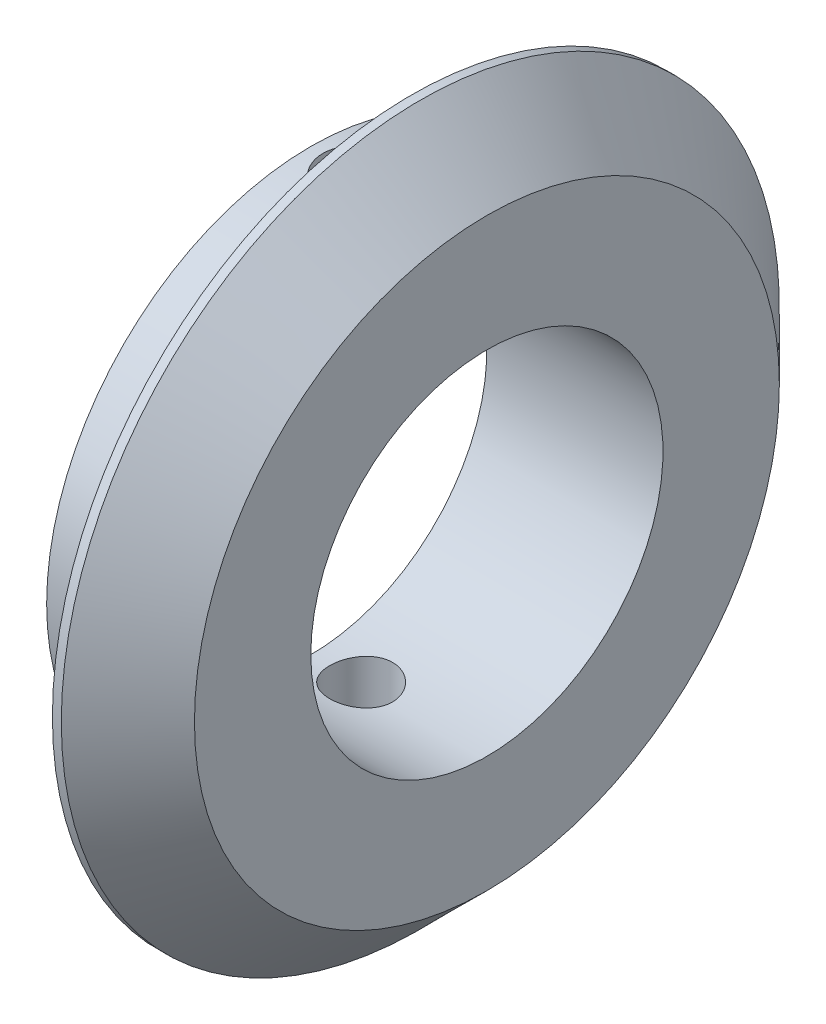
ISO-10303-21;
HEADER;
FILE_DESCRIPTION(('STEP AP214'),'2;1');
FILE_NAME('part.step','',(''),(''),'','','');
FILE_SCHEMA(('AUTOMOTIVE_DESIGN { 1 0 10303 214 1 1 1 1 }'));
ENDSEC;
DATA;
#1=APPLICATION_CONTEXT('core data for automotive mechanical design processes');
#2=APPLICATION_PROTOCOL_DEFINITION('international standard','automotive_design',2000,#1);
#3=PRODUCT_CONTEXT('',#1,'mechanical');
#4=PRODUCT('Part','Part','',(#3));
#5=PRODUCT_RELATED_PRODUCT_CATEGORY('part','',(#4));
#6=PRODUCT_DEFINITION_FORMATION('','',#4);
#7=PRODUCT_DEFINITION_CONTEXT('part definition',#1,'design');
#8=PRODUCT_DEFINITION('design','',#6,#7);
#9=PRODUCT_DEFINITION_SHAPE('','',#8);
#10=(LENGTH_UNIT() NAMED_UNIT(*) SI_UNIT(.MILLI.,.METRE.));
#11=(NAMED_UNIT(*) PLANE_ANGLE_UNIT() SI_UNIT($,.RADIAN.));
#12=(NAMED_UNIT(*) SI_UNIT($,.STERADIAN.) SOLID_ANGLE_UNIT());
#13=UNCERTAINTY_MEASURE_WITH_UNIT(LENGTH_MEASURE(1.E-05),#10,'distance_accuracy_value','');
#14=(GEOMETRIC_REPRESENTATION_CONTEXT(3) GLOBAL_UNCERTAINTY_ASSIGNED_CONTEXT((#13)) GLOBAL_UNIT_ASSIGNED_CONTEXT((#10,
#11,#12)) REPRESENTATION_CONTEXT('',''));
#15=CARTESIAN_POINT('',(0.,0.,0.));
#16=DIRECTION('',(0.,0.,1.));
#17=DIRECTION('',(1.,0.,0.));
#18=AXIS2_PLACEMENT_3D('',#15,#16,#17);
#19=CARTESIAN_POINT('',(3.9619976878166,20.,0.));
#20=DIRECTION('',(0.,1.,0.));
#21=DIRECTION('',(-1.,0.,0.));
#22=AXIS2_PLACEMENT_3D('',#19,#20,#21);
#23=CYLINDRICAL_SURFACE('',#22,3.);
#24=CARTESIAN_POINT('',(6.93633446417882,20.9963491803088,-0.391561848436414));
#25=CARTESIAN_POINT('',(6.91924504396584,20.9939283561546,-0.521374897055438));
#26=CARTESIAN_POINT('',(6.89364712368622,20.990317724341,-0.650044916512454));
#27=CARTESIAN_POINT('',(6.82588533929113,20.9809611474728,-0.90293604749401));
#28=CARTESIAN_POINT('',(6.78371274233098,20.9752140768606,-1.0271547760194));
#29=CARTESIAN_POINT('',(6.68352675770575,20.9619717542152,-1.2690256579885));
#30=CARTESIAN_POINT('',(6.62550292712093,20.9544753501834,-1.38667342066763));
#31=CARTESIAN_POINT('',(6.49460727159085,20.9382401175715,-1.61339170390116));
#32=CARTESIAN_POINT('',(6.42172693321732,20.9295005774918,-1.72245725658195));
#33=CARTESIAN_POINT('',(6.26236201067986,20.9113704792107,-1.93014581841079));
#34=CARTESIAN_POINT('',(6.17587291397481,20.901979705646,-2.0287653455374));
#35=CARTESIAN_POINT('',(5.99076378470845,20.8831851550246,-2.21387464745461));
#36=CARTESIAN_POINT('',(5.89214358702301,20.8737813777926,-2.30036425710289));
#37=CARTESIAN_POINT('',(5.68445450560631,20.855602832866,-2.4597295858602));
#38=CARTESIAN_POINT('',(5.5753890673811,20.8468278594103,-2.53260977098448));
#39=CARTESIAN_POINT('',(5.34867109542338,20.8305087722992,-2.66350524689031));
#40=CARTESIAN_POINT('',(5.23102350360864,20.8229639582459,-2.72152900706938));
#41=CARTESIAN_POINT('',(4.98915286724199,20.8096248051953,-2.8217148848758));
#42=CARTESIAN_POINT('',(4.8649342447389,20.8038293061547,-2.86388751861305));
#43=CARTESIAN_POINT('',(4.61204303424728,20.7943888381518,-2.93164931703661));
#44=CARTESIAN_POINT('',(4.48337286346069,20.7907427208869,-2.95724733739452));
#45=CARTESIAN_POINT('',(4.22380038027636,20.7858536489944,-2.99141907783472));
#46=CARTESIAN_POINT('',(4.09289903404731,20.784609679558,-2.99999998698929));
#47=CARTESIAN_POINT('',(3.83109634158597,20.7846096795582,-2.99999998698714));
#48=CARTESIAN_POINT('',(3.70019499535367,20.7858536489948,-2.99141907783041));
#49=CARTESIAN_POINT('',(3.44062251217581,20.7907427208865,-2.95724733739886));
#50=CARTESIAN_POINT('',(3.31195234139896,20.7943888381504,-2.93164931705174));
#51=CARTESIAN_POINT('',(3.05906113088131,20.8038293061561,-2.86388751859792));
#52=CARTESIAN_POINT('',(2.93484250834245,20.8096248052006,-2.8217148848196));
#53=CARTESIAN_POINT('',(2.69297187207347,20.8229639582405,-2.72152900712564));
#54=CARTESIAN_POINT('',(2.57532428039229,20.8305087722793,-2.66350524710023));
#55=CARTESIAN_POINT('',(2.34860630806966,20.8468278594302,-2.53260977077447));
#56=CARTESIAN_POINT('',(2.2395408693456,20.8556028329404,-2.45972958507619));
#57=CARTESIAN_POINT('',(2.03185250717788,20.8737813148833,-2.30036480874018));
#58=CARTESIAN_POINT('',(1.93323295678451,20.8831850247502,-2.21387584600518));
#59=CARTESIAN_POINT('',(1.74812366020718,20.9019795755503,-2.02876671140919));
#60=CARTESIAN_POINT('',(1.6616339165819,20.9113704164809,-1.93014653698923));
#61=CARTESIAN_POINT('',(1.50226844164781,20.9295005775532,-1.72245725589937));
#62=CARTESIAN_POINT('',(1.42938810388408,20.9382401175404,-1.61339170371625));
#63=CARTESIAN_POINT('',(1.29849244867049,20.9544753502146,-1.38667342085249));
#64=CARTESIAN_POINT('',(1.24046861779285,20.961971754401,-1.26902565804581));
#65=CARTESIAN_POINT('',(1.14028263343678,20.9752140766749,-1.02715477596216));
#66=CARTESIAN_POINT('',(1.09811003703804,20.9809611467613,-0.902936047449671));
#67=CARTESIAN_POINT('',(1.0303482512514,20.9903177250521,-0.650044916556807));
#68=CARTESIAN_POINT('',(1.00475032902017,20.9939283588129,-0.521374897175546));
#69=CARTESIAN_POINT('',(0.970578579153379,20.9987689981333,-0.261802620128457));
#70=CARTESIAN_POINT('',(0.961997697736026,20.9999999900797,-0.130901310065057));
#71=CARTESIAN_POINT('',(0.961997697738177,20.9999999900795,0.130901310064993));
#72=CARTESIAN_POINT('',(0.97057857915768,20.9987689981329,0.261802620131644));
#73=CARTESIAN_POINT('',(1.00475032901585,20.9939283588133,0.521374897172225));
#74=CARTESIAN_POINT('',(1.03034825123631,20.9903177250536,0.650044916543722));
#75=CARTESIAN_POINT('',(1.09811003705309,20.9809611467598,0.90293604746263));
#76=CARTESIAN_POINT('',(1.14028263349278,20.9752140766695,1.02715477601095));
#77=CARTESIAN_POINT('',(1.24046861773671,20.9619717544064,1.26902565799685));
#78=CARTESIAN_POINT('',(1.29849244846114,20.9544753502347,1.38667342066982));
#79=CARTESIAN_POINT('',(1.42938810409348,20.9382401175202,1.6133917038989));
#80=CARTESIAN_POINT('',(1.50226844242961,20.929500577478,1.72245725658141));
#81=CARTESIAN_POINT('',(1.66163336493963,20.9113704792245,1.93014581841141));
#82=CARTESIAN_POINT('',(1.74812246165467,20.9019797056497,2.0287653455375));
#83=CARTESIAN_POINT('',(1.93323159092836,20.8831851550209,2.21387464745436));
#84=CARTESIAN_POINT('',(2.03185178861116,20.8737813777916,2.30036425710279));
#85=CARTESIAN_POINT('',(2.23954087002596,20.855602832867,2.45972958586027));
#86=CARTESIAN_POINT('',(2.34860630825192,20.8468278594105,2.53260977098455));
#87=CARTESIAN_POINT('',(2.57532428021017,20.830508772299,2.66350524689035));
#88=CARTESIAN_POINT('',(2.69297187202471,20.8229639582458,2.72152900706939));
#89=CARTESIAN_POINT('',(2.93484250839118,20.8096248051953,2.82171488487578));
#90=CARTESIAN_POINT('',(3.05906113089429,20.8038293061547,2.86388751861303));
#91=CARTESIAN_POINT('',(3.31195234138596,20.7943888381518,2.93164931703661));
#92=CARTESIAN_POINT('',(3.44062251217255,20.7907427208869,2.95724733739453));
#93=CARTESIAN_POINT('',(3.70019499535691,20.7858536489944,2.99141907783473));
#94=CARTESIAN_POINT('',(3.83109634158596,20.784609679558,2.9999999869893));
#95=CARTESIAN_POINT('',(4.09289903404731,20.7846096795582,2.99999998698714));
#96=CARTESIAN_POINT('',(4.22380038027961,20.7858536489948,2.9914190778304));
#97=CARTESIAN_POINT('',(4.48337286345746,20.7907427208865,2.95724733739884));
#98=CARTESIAN_POINT('',(4.6120430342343,20.7943888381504,2.93164931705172));
#99=CARTESIAN_POINT('',(4.8649342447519,20.8038293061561,2.86388751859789));
#100=CARTESIAN_POINT('',(4.98915286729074,20.8096248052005,2.82171488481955));
#101=CARTESIAN_POINT('',(5.23102350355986,20.8229639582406,2.72152900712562));
#102=CARTESIAN_POINT('',(5.34867109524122,20.8305087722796,2.66350524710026));
#103=CARTESIAN_POINT('',(5.57538906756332,20.8468278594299,2.53260977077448));
#104=CARTESIAN_POINT('',(5.68445450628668,20.8556028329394,2.45972958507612));
#105=CARTESIAN_POINT('',(5.89214286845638,20.8737813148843,2.30036480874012));
#106=CARTESIAN_POINT('',(5.99076241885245,20.8831850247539,2.21387584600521));
#107=CARTESIAN_POINT('',(6.17587171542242,20.9019795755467,2.02876671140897));
#108=CARTESIAN_POINT('',(6.26236145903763,20.9113704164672,1.93014653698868));
#109=CARTESIAN_POINT('',(6.42172693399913,20.9295005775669,1.7224572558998));
#110=CARTESIAN_POINT('',(6.49460727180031,20.9382401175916,1.613391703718));
#111=CARTESIAN_POINT('',(6.62550292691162,20.9544753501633,1.38667342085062));
#112=CARTESIAN_POINT('',(6.68352675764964,20.9619717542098,1.26902565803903));
#113=CARTESIAN_POINT('',(6.78371274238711,20.9752140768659,1.02715477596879));
#114=CARTESIAN_POINT('',(6.82588533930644,20.9809611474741,0.902936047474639));
#115=CARTESIAN_POINT('',(6.89364712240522,20.9903177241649,0.650044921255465));
#116=CARTESIAN_POINT('',(6.91924504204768,20.9939283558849,0.521374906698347));
#117=CARTESIAN_POINT('',(6.95341679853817,20.9987690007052,0.261802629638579));
#118=CARTESIAN_POINT('',(6.9619976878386,21.000000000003,0.130901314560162));
#119=CARTESIAN_POINT('',(6.96199768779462,20.9999999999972,-0.130901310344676));
#120=CARTESIAN_POINT('',(6.95341679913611,20.9987690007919,-0.261802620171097));
#121=CARTESIAN_POINT('',(6.93633446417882,20.9963491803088,-0.391561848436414));
#122=B_SPLINE_CURVE_WITH_KNOTS('',3,(#24,#25,#26,#27,#28,#29,#30,#31,#32,#33,#34,#35,#36,#37,
#38,#39,#40,#41,#42,#43,#44,#45,#46,#47,#48,#49,#50,#51,#52,#53,#54,#55,#56,#57,#58,#59,#60,#61,
#62,#63,#64,#65,#66,#67,#68,#69,#70,#71,#72,#73,#74,#75,#76,#77,#78,#79,#80,#81,#82,#83,#84,#85,
#86,#87,#88,#89,#90,#91,#92,#93,#94,#95,#96,#97,#98,#99,#100,#101,#102,#103,#104,#105,#106,#107,
#108,#109,#110,#111,#112,#113,#114,#115,#116,#117,#118,#119,#120,#121),.UNSPECIFIED.,.T.,.F.,(4,
2,2,2,2,2,2,2,2,2,2,2,2,2,2,2,2,2,2,2,2,2,2,2,2,2,2,2,2,2,2,2,2,2,2,2,2,2,2,2,2,2,2,2,2,2,2,2,
4),(0.,0.392581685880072,0.785370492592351,1.17841869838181,1.57169277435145,1.96509753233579,
2.35850764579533,2.75178843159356,3.14484451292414,3.53763936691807,3.93022418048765,
4.32264310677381,4.71506203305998,5.10764684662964,5.50044170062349,5.89349778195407,
6.28677856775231,6.68018596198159,7.07359343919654,7.46686751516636,7.85991572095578,
8.25270452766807,8.64528621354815,9.03770513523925,9.43012405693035,9.82270574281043,
10.2154945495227,10.6085427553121,11.001816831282,11.395221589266,11.7886317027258,
12.1819124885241,12.5749685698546,12.9677634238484,13.3603482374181,13.7527671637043,
14.1451860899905,14.5377709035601,14.930565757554,15.3236218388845,15.7169026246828,
16.1103100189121,16.503717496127,16.8969915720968,17.2900397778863,17.6828285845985,
18.0754102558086,18.4678291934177,18.8602481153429),.UNSPECIFIED.);
#123=CARTESIAN_POINT('',(6.93633446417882,20.9963491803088,-0.391561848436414));
#124=VERTEX_POINT('',#123);
#125=EDGE_CURVE('E70',#124,#124,#122,.T.);
#126=ORIENTED_EDGE('',*,*,#125,.T.);
#127=EDGE_LOOP('',(#126));
#128=FACE_BOUND('',#127,.T.);
#129=CARTESIAN_POINT('',(3.9619976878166,20.,0.));
#130=DIRECTION('',(0.,1.,0.));
#131=DIRECTION('',(-1.,0.,0.));
#132=AXIS2_PLACEMENT_3D('',#129,#130,#131);
#133=CIRCLE('',#132,3.);
#134=CARTESIAN_POINT('',(0.961997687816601,20.,0.));
#135=VERTEX_POINT('',#134);
#136=EDGE_CURVE('E19',#135,#135,#133,.F.);
#137=ORIENTED_EDGE('',*,*,#136,.T.);
#138=EDGE_LOOP('',(#137));
#139=FACE_BOUND('',#138,.T.);
#140=ADVANCED_FACE('F15',(#128,#139),#23,.F.);
#141=CARTESIAN_POINT('',(0.90199768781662,20.,3.));
#142=DIRECTION('',(0.,-1.,0.));
#143=DIRECTION('',(0.,0.,-1.));
#144=AXIS2_PLACEMENT_3D('',#141,#142,#143);
#145=PLANE('',#144);
#146=CARTESIAN_POINT('',(4.,20.,0.));
#147=DIRECTION('',(0.,1.,0.));
#148=DIRECTION('',(0.,0.,1.));
#149=AXIS2_PLACEMENT_3D('',#146,#147,#148);
#150=CIRCLE('',#149,2.5);
#151=CARTESIAN_POINT('',(4.,20.,2.5));
#152=VERTEX_POINT('',#151);
#153=EDGE_CURVE('E112',#152,#152,#150,.T.);
#154=ORIENTED_EDGE('',*,*,#153,.F.);
#155=EDGE_LOOP('',(#154));
#156=FACE_BOUND('',#155,.T.);
#157=ORIENTED_EDGE('',*,*,#136,.F.);
#158=EDGE_LOOP('',(#157));
#159=FACE_BOUND('',#158,.T.);
#160=ADVANCED_FACE('F50',(#156,#159),#145,.F.);
#161=CARTESIAN_POINT('',(4.,13.7376271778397,0.));
#162=DIRECTION('',(0.,1.,0.));
#163=DIRECTION('',(0.,0.,1.));
#164=AXIS2_PLACEMENT_3D('',#161,#162,#163);
#165=CYLINDRICAL_SURFACE('',#164,2.5);
#166=ORIENTED_EDGE('',*,*,#153,.T.);
#167=EDGE_LOOP('',(#166));
#168=FACE_BOUND('',#167,.T.);
#169=CARTESIAN_POINT('',(4.00000016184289,13.7749773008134,2.49999998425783));
#170=CARTESIAN_POINT('',(4.10908546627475,13.7749773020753,2.49999997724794));
#171=CARTESIAN_POINT('',(4.21817076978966,13.776280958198,2.49284860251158));
#172=CARTESIAN_POINT('',(4.43448750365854,13.7814033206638,2.46437210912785));
#173=CARTESIAN_POINT('',(4.54171764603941,13.7852237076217,2.44303751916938));
#174=CARTESIAN_POINT('',(4.75246644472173,13.7951119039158,2.38656780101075));
#175=CARTESIAN_POINT('',(4.85598189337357,13.8011816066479,2.35142104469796));
#176=CARTESIAN_POINT('',(5.05754062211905,13.8151463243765,2.26793297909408));
#177=CARTESIAN_POINT('',(5.15557806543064,13.8230432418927,2.21957790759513));
#178=CARTESIAN_POINT('',(5.3445064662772,13.8401167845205,2.11050030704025));
#179=CARTESIAN_POINT('',(5.43539094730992,13.8492945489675,2.04976674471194));
#180=CARTESIAN_POINT('',(5.60845991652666,13.8682996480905,1.91696641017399));
#181=CARTESIAN_POINT('',(5.69063998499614,13.8781273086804,1.84489392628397));
#182=CARTESIAN_POINT('',(5.84489264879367,13.8977613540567,1.69064125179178));
#183=CARTESIAN_POINT('',(5.91696541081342,13.9075677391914,1.60846122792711));
#184=CARTESIAN_POINT('',(6.04976604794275,13.9264933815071,1.43539184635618));
#185=CARTESIAN_POINT('',(6.11049992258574,13.9356130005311,1.34450713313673));
#186=CARTESIAN_POINT('',(6.21957789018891,13.9525488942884,1.15557809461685));
#187=CARTESIAN_POINT('',(6.2679331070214,13.9603663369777,1.05754029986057));
#188=CARTESIAN_POINT('',(6.35142139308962,13.9741720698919,0.855981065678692));
#189=CARTESIAN_POINT('',(6.38656807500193,13.9801622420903,0.752465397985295));
#190=CARTESIAN_POINT('',(6.44303776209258,13.9899127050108,0.541716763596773));
#191=CARTESIAN_POINT('',(6.46437214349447,13.9936748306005,0.434486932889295));
#192=CARTESIAN_POINT('',(6.49284866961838,13.9987176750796,0.218170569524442));
#193=CARTESIAN_POINT('',(6.49999999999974,13.9999999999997,0.109085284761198));
#194=CARTESIAN_POINT('',(6.50000000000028,13.9999999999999,-0.109085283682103));
#195=CARTESIAN_POINT('',(6.49284866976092,13.9987176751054,-0.218170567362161));
#196=CARTESIAN_POINT('',(6.4643721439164,13.9936748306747,-0.434486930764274));
#197=CARTESIAN_POINT('',(6.44303776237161,13.9899127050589,-0.54171676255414));
#198=CARTESIAN_POINT('',(6.38656807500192,13.9801622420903,-0.75246539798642));
#199=CARTESIAN_POINT('',(6.35142139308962,13.9741720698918,-0.855981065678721));
#200=CARTESIAN_POINT('',(6.26793310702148,13.9603663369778,-1.05754029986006));
#201=CARTESIAN_POINT('',(6.21957789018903,13.9525488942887,-1.15557809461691));
#202=CARTESIAN_POINT('',(6.1104999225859,13.9356130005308,-1.34450713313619));
#203=CARTESIAN_POINT('',(6.04976604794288,13.9264933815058,-1.43539184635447));
#204=CARTESIAN_POINT('',(5.91696541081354,13.9075677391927,-1.60846122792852));
#205=CARTESIAN_POINT('',(5.84489264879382,13.8977613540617,-1.69064125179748));
#206=CARTESIAN_POINT('',(5.69063998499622,13.8781273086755,-1.84489392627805));
#207=CARTESIAN_POINT('',(5.60845991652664,13.8682996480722,-1.91696641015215));
#208=CARTESIAN_POINT('',(5.43539094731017,13.8492945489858,-2.0497667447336));
#209=CARTESIAN_POINT('',(5.3445064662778,13.8401167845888,-2.11050030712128));
#210=CARTESIAN_POINT('',(5.15557806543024,13.8230432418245,-2.21957790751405));
#211=CARTESIAN_POINT('',(5.05754062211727,13.8151463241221,-2.26793297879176));
#212=CARTESIAN_POINT('',(4.85598189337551,13.8011816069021,-2.35142104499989));
#213=CARTESIAN_POINT('',(4.75246644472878,13.795111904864,-2.38656780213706));
#214=CARTESIAN_POINT('',(4.54171764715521,13.7852237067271,-2.44303751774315));
#215=CARTESIAN_POINT('',(4.43448750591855,13.7814033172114,-2.46437210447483));
#216=CARTESIAN_POINT('',(4.21817071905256,13.7762809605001,-2.49284861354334));
#217=CARTESIAN_POINT('',(4.10908536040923,13.7749773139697,-2.49999999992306));
#218=CARTESIAN_POINT('',(3.89091464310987,13.7749773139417,-2.50000000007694));
#219=CARTESIAN_POINT('',(3.78182928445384,13.7762809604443,-2.49284861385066));
#220=CARTESIAN_POINT('',(3.56551249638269,13.7814033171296,-2.46437210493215));
#221=CARTESIAN_POINT('',(3.45828235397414,13.7852237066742,-2.44303751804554));
#222=CARTESIAN_POINT('',(3.24753355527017,13.7951119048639,-2.38656780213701));
#223=CARTESIAN_POINT('',(3.14401810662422,13.8011816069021,-2.35142104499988));
#224=CARTESIAN_POINT('',(2.94245937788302,13.8151463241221,-2.26793297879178));
#225=CARTESIAN_POINT('',(2.84442193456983,13.8230432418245,-2.21957790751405));
#226=CARTESIAN_POINT('',(2.65549353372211,13.8401167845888,-2.11050030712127));
#227=CARTESIAN_POINT('',(2.5646090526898,13.8492945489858,-2.04976674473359));
#228=CARTESIAN_POINT('',(2.39154008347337,13.8682996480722,-1.91696641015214));
#229=CARTESIAN_POINT('',(2.30936001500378,13.8781273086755,-1.84489392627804));
#230=CARTESIAN_POINT('',(2.15510735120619,13.8977613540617,-1.6906412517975));
#231=CARTESIAN_POINT('',(2.08303458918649,13.9075677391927,-1.60846122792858));
#232=CARTESIAN_POINT('',(1.95023395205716,13.9264933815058,-1.43539184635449));
#233=CARTESIAN_POINT('',(1.88950007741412,13.9356130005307,-1.34450713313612));
#234=CARTESIAN_POINT('',(1.78042210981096,13.9525488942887,-1.155578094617));
#235=CARTESIAN_POINT('',(1.73206689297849,13.9603663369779,-1.05754029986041));
#236=CARTESIAN_POINT('',(1.6485786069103,13.9741720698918,-0.855981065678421));
#237=CARTESIAN_POINT('',(1.61343192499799,13.9801622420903,-0.752465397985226));
#238=CARTESIAN_POINT('',(1.55696223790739,13.9899127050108,-0.54171676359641));
#239=CARTESIAN_POINT('',(1.53562785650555,13.9936748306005,-0.434486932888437));
#240=CARTESIAN_POINT('',(1.5071513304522,13.9987176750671,-0.218170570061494));
#241=CARTESIAN_POINT('',(1.50000000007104,13.9999999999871,-0.109085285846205));
#242=CARTESIAN_POINT('',(1.49999999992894,14.0000000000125,0.109085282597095));
#243=CARTESIAN_POINT('',(1.5071513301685,13.9987176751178,0.218170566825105));
#244=CARTESIAN_POINT('',(1.53562785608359,13.9936748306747,0.434486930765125));
#245=CARTESIAN_POINT('',(1.55696223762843,13.9899127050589,0.541716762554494));
#246=CARTESIAN_POINT('',(1.61343192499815,13.9801622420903,0.752465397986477));
#247=CARTESIAN_POINT('',(1.64857860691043,13.9741720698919,0.855981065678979));
#248=CARTESIAN_POINT('',(1.73206689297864,13.9603663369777,1.05754029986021));
#249=CARTESIAN_POINT('',(1.78042210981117,13.9525488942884,1.15557809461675));
#250=CARTESIAN_POINT('',(1.88950007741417,13.9356130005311,1.34450713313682));
#251=CARTESIAN_POINT('',(1.95023395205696,13.9264933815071,1.4353918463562));
#252=CARTESIAN_POINT('',(2.08303458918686,13.9075677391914,1.60846122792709));
#253=CARTESIAN_POINT('',(2.15510735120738,13.8977613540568,1.69064125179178));
#254=CARTESIAN_POINT('',(2.30936001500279,13.8781273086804,1.84489392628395));
#255=CARTESIAN_POINT('',(2.39154008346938,13.8682996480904,1.91696641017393));
#256=CARTESIAN_POINT('',(2.56460905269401,13.8492945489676,2.04976674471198));
#257=CARTESIAN_POINT('',(2.65549353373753,13.840116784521,2.11050030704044));
#258=CARTESIAN_POINT('',(2.84442193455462,13.8230432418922,2.21957790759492));
#259=CARTESIAN_POINT('',(2.94245937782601,13.8151463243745,2.26793297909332));
#260=CARTESIAN_POINT('',(3.14401810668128,13.8011816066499,2.3514210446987));
#261=CARTESIAN_POINT('',(3.24753355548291,13.7951119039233,2.38656780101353));
#262=CARTESIAN_POINT('',(3.45828222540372,13.7852237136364,2.44303748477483));
#263=CARTESIAN_POINT('',(3.56551223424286,13.7814033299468,2.46437205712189));
#264=CARTESIAN_POINT('',(3.78182907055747,13.7762809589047,2.49284859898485));
#265=CARTESIAN_POINT('',(3.89091461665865,13.7749772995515,2.49999999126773));
#266=CARTESIAN_POINT('',(4.00000016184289,13.7749773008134,2.49999998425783));
#267=B_SPLINE_CURVE_WITH_KNOTS('',3,(#169,#170,#171,#172,#173,#174,#175,#176,#177,#178,#179,
#180,#181,#182,#183,#184,#185,#186,#187,#188,#189,#190,#191,#192,#193,#194,#195,#196,#197,#198,
#199,#200,#201,#202,#203,#204,#205,#206,#207,#208,#209,#210,#211,#212,#213,#214,#215,#216,#217,
#218,#219,#220,#221,#222,#223,#224,#225,#226,#227,#228,#229,#230,#231,#232,#233,#234,#235,#236,
#237,#238,#239,#240,#241,#242,#243,#244,#245,#246,#247,#248,#249,#250,#251,#252,#253,#254,#255,
#256,#257,#258,#259,#260,#261,#262,#263,#264,#265,#266),.UNSPECIFIED.,.T.,.F.,(4,2,2,2,2,2,2,2,
2,2,2,2,2,2,2,2,2,2,2,2,2,2,2,2,2,2,2,2,2,2,2,2,2,2,2,2,2,2,2,2,2,2,2,2,2,2,2,2,4),(0.,
0.327015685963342,0.654249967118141,0.981760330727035,1.30961324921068,1.63775967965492,
1.96607193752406,2.2943787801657,2.62251141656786,2.95034813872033,3.27784606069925,
3.60507390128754,3.93208974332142,4.25910558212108,4.58633342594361,4.91383134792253,
5.24166807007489,5.56980070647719,5.89810754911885,6.22641980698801,6.55456623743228,
6.88241915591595,7.20992951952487,7.53716379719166,7.86417964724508,8.19119549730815,
8.51842977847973,8.84594014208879,9.17379306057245,9.50193949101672,9.83025174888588,
10.1585585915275,10.4866912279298,10.8145279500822,11.1420258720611,11.4692537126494,
11.7962695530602,12.1232853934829,12.4505132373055,12.7780111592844,13.1058478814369,
13.433980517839,13.7622873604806,14.0905996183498,14.418746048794,14.7465989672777,
15.0741093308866,15.4013432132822,15.7283596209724),.UNSPECIFIED.);
#268=CARTESIAN_POINT('',(4.00000016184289,13.7749773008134,2.49999998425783));
#269=VERTEX_POINT('',#268);
#270=EDGE_CURVE('E10',#269,#269,#267,.T.);
#271=ORIENTED_EDGE('',*,*,#270,.F.);
#272=EDGE_LOOP('',(#271));
#273=FACE_BOUND('',#272,.T.);
#274=ADVANCED_FACE('F44',(#168,#273),#165,.F.);
#275=CARTESIAN_POINT('',(8.,-39.868777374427,6.3145939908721));
#276=DIRECTION('',(-1.,0.,0.));
#277=DIRECTION('',(0.,0.809016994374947,0.587785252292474));
#278=AXIS2_PLACEMENT_3D('',#275,#276,#277);
#279=PLANE('',#278);
#280=CARTESIAN_POINT('',(8.,0.,0.));
#281=DIRECTION('',(-1.,0.,0.));
#282=DIRECTION('',(0.,0.,1.));
#283=AXIS2_PLACEMENT_3D('',#280,#281,#282);
#284=CIRCLE('',#283,21.0000000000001);
#285=CARTESIAN_POINT('',(8.,0.,21.0000000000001));
#286=VERTEX_POINT('',#285);
#287=EDGE_CURVE('E111',#286,#286,#284,.F.);
#288=ORIENTED_EDGE('',*,*,#287,.T.);
#289=EDGE_LOOP('',(#288));
#290=FACE_BOUND('',#289,.T.);
#291=CARTESIAN_POINT('',(8.,0.,0.));
#292=DIRECTION('',(-1.,0.,0.));
#293=DIRECTION('',(0.,0.,1.));
#294=AXIS2_PLACEMENT_3D('',#291,#292,#293);
#295=CIRCLE('',#294,28.5428932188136);
#296=CARTESIAN_POINT('',(8.,0.,28.5428932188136));
#297=VERTEX_POINT('',#296);
#298=EDGE_CURVE('E109',#297,#297,#295,.T.);
#299=ORIENTED_EDGE('',*,*,#298,.T.);
#300=EDGE_LOOP('',(#299));
#301=FACE_BOUND('',#300,.T.);
#302=ADVANCED_FACE('F49',(#290,#301),#279,.T.);
#303=CARTESIAN_POINT('',(8.7071067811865,0.,0.));
#304=DIRECTION('',(-1.,0.,0.));
#305=DIRECTION('',(0.,0.,1.));
#306=AXIS2_PLACEMENT_3D('',#303,#304,#305);
#307=CYLINDRICAL_SURFACE('',#306,28.5428932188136);
#308=CARTESIAN_POINT('',(8.7071067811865,0.,0.));
#309=DIRECTION('',(-1.,0.,0.));
#310=DIRECTION('',(0.,0.80901699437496,0.587785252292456));
#311=AXIS2_PLACEMENT_3D('',#308,#309,#310);
#312=CIRCLE('',#311,28.5428932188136);
#313=CARTESIAN_POINT('',(8.7071067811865,23.09168568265,16.777091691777));
#314=VERTEX_POINT('',#313);
#315=EDGE_CURVE('E75',#314,#314,#312,.T.);
#316=ORIENTED_EDGE('',*,*,#315,.T.);
#317=EDGE_LOOP('',(#316));
#318=FACE_BOUND('',#317,.T.);
#319=ORIENTED_EDGE('',*,*,#298,.F.);
#320=EDGE_LOOP('',(#319));
#321=FACE_BOUND('',#320,.T.);
#322=ADVANCED_FACE('F53',(#318,#321),#307,.T.);
#323=CARTESIAN_POINT('',(8.,0.,0.));
#324=DIRECTION('',(-1.,0.,0.));
#325=DIRECTION('',(0.,0.,1.));
#326=AXIS2_PLACEMENT_3D('',#323,#324,#325);
#327=CYLINDRICAL_SURFACE('',#326,21.0000000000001);
#328=ORIENTED_EDGE('',*,*,#287,.F.);
#329=EDGE_LOOP('',(#328));
#330=FACE_BOUND('',#329,.T.);
#331=ORIENTED_EDGE('',*,*,#125,.F.);
#332=EDGE_LOOP('',(#331));
#333=FACE_BOUND('',#332,.T.);
#334=CARTESIAN_POINT('',(3.67366169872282,-20.8532130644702,2.47860910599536));
#335=CARTESIAN_POINT('',(3.56552217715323,-20.8549053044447,2.46437127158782));
#336=CARTESIAN_POINT('',(3.45832910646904,-20.8574285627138,2.4430474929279));
#337=CARTESIAN_POINT('',(3.24759919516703,-20.8639641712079,2.38658780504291));
#338=CARTESIAN_POINT('',(3.14406540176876,-20.8679777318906,2.35144066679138));
#339=CARTESIAN_POINT('',(2.94248925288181,-20.877216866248,2.26794530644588));
#340=CARTESIAN_POINT('',(2.84444849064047,-20.8824427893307,2.21959327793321));
#341=CARTESIAN_POINT('',(2.65551536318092,-20.8937487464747,2.11051284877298));
#342=CARTESIAN_POINT('',(2.56462583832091,-20.8998291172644,2.04977956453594));
#343=CARTESIAN_POINT('',(2.39154897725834,-20.9124282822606,1.91697324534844));
#344=CARTESIAN_POINT('',(2.30936366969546,-20.918947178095,1.84489757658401));
#345=CARTESIAN_POINT('',(2.15510327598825,-20.9319786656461,1.6906371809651));
#346=CARTESIAN_POINT('',(2.0830280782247,-20.9384912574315,1.6084525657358));
#347=CARTESIAN_POINT('',(1.95022179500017,-20.9510671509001,1.43537611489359));
#348=CARTESIAN_POINT('',(1.88948815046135,-20.9571305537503,1.34448625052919));
#349=CARTESIAN_POINT('',(1.78040728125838,-20.9683963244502,1.15555259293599));
#350=CARTESIAN_POINT('',(1.73205512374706,-20.9735990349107,1.05751166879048));
#351=CARTESIAN_POINT('',(1.64855966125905,-20.982791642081,0.855935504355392));
#352=CARTESIAN_POINT('',(1.61341254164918,-20.9867818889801,0.752401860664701));
#353=CARTESIAN_POINT('',(1.55695237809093,-20.9932772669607,0.54167073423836));
#354=CARTESIAN_POINT('',(1.53562836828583,-20.995783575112,0.43447622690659));
#355=CARTESIAN_POINT('',(1.50715175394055,-20.9991449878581,0.218187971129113));
#356=CARTESIAN_POINT('',(1.50000002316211,-20.9999999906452,0.109094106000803));
#357=CARTESIAN_POINT('',(1.49999998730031,-20.9999999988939,-0.109083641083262));
#358=CARTESIAN_POINT('',(1.50715038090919,-20.999145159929,-0.218167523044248));
#359=CARTESIAN_POINT('',(1.5356267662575,-20.995783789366,-0.434474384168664));
#360=CARTESIAN_POINT('',(1.55695685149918,-20.9932767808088,-0.541696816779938));
#361=CARTESIAN_POINT('',(1.61342414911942,-20.9867806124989,-0.752436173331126));
#362=CARTESIAN_POINT('',(1.64856640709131,-20.9827909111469,-0.855951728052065));
#363=CARTESIAN_POINT('',(1.73205468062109,-20.9735990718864,-1.05751066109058));
#364=CARTESIAN_POINT('',(1.78040673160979,-20.9683963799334,-1.1555515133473));
#365=CARTESIAN_POINT('',(1.88948723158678,-20.9571306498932,-1.34448478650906));
#366=CARTESIAN_POINT('',(1.950220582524,-20.9510672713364,-1.43537435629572));
#367=CARTESIAN_POINT('',(2.08302696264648,-20.9384913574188,-1.60845129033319));
#368=CARTESIAN_POINT('',(2.15510268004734,-20.9319787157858,-1.69063658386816));
#369=CARTESIAN_POINT('',(2.30936305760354,-20.9189472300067,-1.84489696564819));
#370=CARTESIAN_POINT('',(2.39154767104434,-20.9124283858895,-1.91697210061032));
#371=CARTESIAN_POINT('',(2.56462403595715,-20.8998292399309,-2.04977832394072));
#372=CARTESIAN_POINT('',(2.65551386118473,-20.893748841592,-2.11051191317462));
#373=CARTESIAN_POINT('',(2.84444740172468,-20.8824428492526,-2.21959271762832));
#374=CARTESIAN_POINT('',(2.94248825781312,-20.8772169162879,-2.26794484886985));
#375=CARTESIAN_POINT('',(3.14406454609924,-20.867977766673,-2.35144035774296));
#376=CARTESIAN_POINT('',(3.2475983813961,-20.8639641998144,-2.38658755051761));
#377=CARTESIAN_POINT('',(3.45832844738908,-20.8574285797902,-2.44304735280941));
#378=CARTESIAN_POINT('',(3.56552163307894,-20.8549053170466,-2.46437118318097));
#379=CARTESIAN_POINT('',(3.78180966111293,-20.8515206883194,-2.49284806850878));
#380=CARTESIAN_POINT('',(3.8909046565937,-20.8506594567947,-2.4999999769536));
#381=CARTESIAN_POINT('',(4.1090946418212,-20.8506594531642,-2.50000000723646));
#382=CARTESIAN_POINT('',(4.21818963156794,-20.8515206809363,-2.4928481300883));
#383=CARTESIAN_POINT('',(4.43447763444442,-20.8549053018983,-2.46437131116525));
#384=CARTESIAN_POINT('',(4.54167080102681,-20.8574285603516,-2.44304751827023));
#385=CARTESIAN_POINT('',(4.75240080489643,-20.8639641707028,-2.38658780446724));
#386=CARTESIAN_POINT('',(4.85593459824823,-20.8679777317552,-2.35144066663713));
#387=CARTESIAN_POINT('',(5.05751074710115,-20.8772168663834,-2.26794530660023));
#388=CARTESIAN_POINT('',(5.15555150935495,-20.882442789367,-2.2195932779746));
#389=CARTESIAN_POINT('',(5.34448463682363,-20.8937487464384,-2.11051284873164));
#390=CARTESIAN_POINT('',(5.43537416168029,-20.8998291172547,-2.04977956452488));
#391=CARTESIAN_POINT('',(5.60845102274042,-20.9124282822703,-1.91697324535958));
#392=CARTESIAN_POINT('',(5.6906363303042,-20.9189471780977,-1.84489757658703));
#393=CARTESIAN_POINT('',(5.84489672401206,-20.9319786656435,-1.69063718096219));
#394=CARTESIAN_POINT('',(5.91697192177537,-20.9384912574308,-1.60845256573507));
#395=CARTESIAN_POINT('',(6.04977820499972,-20.9510671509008,-1.43537611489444));
#396=CARTESIAN_POINT('',(6.11051184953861,-20.9571305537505,-1.34448625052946));
#397=CARTESIAN_POINT('',(6.21959271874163,-20.96839632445,-1.15555259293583));
#398=CARTESIAN_POINT('',(6.26794487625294,-20.9735990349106,-1.05751166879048));
#399=CARTESIAN_POINT('',(6.35144033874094,-20.9827916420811,-0.855935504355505));
#400=CARTESIAN_POINT('',(6.38658745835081,-20.9867818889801,-0.752401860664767));
#401=CARTESIAN_POINT('',(6.44304762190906,-20.9932772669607,-0.541670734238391));
#402=CARTESIAN_POINT('',(6.46437163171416,-20.995783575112,-0.434476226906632));
#403=CARTESIAN_POINT('',(6.49284824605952,-20.9991449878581,-0.21818797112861));
#404=CARTESIAN_POINT('',(6.49999997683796,-20.9999999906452,-0.109094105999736));
#405=CARTESIAN_POINT('',(6.50000001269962,-20.9999999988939,0.109083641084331));
#406=CARTESIAN_POINT('',(6.49284961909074,-20.999145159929,0.218167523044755));
#407=CARTESIAN_POINT('',(6.46437323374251,-20.995783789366,0.434474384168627));
#408=CARTESIAN_POINT('',(6.44304314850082,-20.9932767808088,0.54169681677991));
#409=CARTESIAN_POINT('',(6.3865758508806,-20.9867806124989,0.752436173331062));
#410=CARTESIAN_POINT('',(6.35143359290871,-20.9827909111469,0.855951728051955));
#411=CARTESIAN_POINT('',(6.26794531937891,-20.9735990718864,1.05751066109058));
#412=CARTESIAN_POINT('',(6.2195932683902,-20.9683963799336,1.15555151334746));
#413=CARTESIAN_POINT('',(6.11051276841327,-20.957130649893,1.3444847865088));
#414=CARTESIAN_POINT('',(6.04977941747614,-20.9510672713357,1.43537435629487));
#415=CARTESIAN_POINT('',(5.91697303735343,-20.9384913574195,1.60845129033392));
#416=CARTESIAN_POINT('',(5.84489731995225,-20.9319787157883,1.69063658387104));
#417=CARTESIAN_POINT('',(5.6906369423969,-20.9189472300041,1.84489696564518));
#418=CARTESIAN_POINT('',(5.60845232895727,-20.9124283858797,1.91697210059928));
#419=CARTESIAN_POINT('',(5.43537596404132,-20.8998292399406,2.0497783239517));
#420=CARTESIAN_POINT('',(5.34448613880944,-20.8937488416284,2.11051191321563));
#421=CARTESIAN_POINT('',(5.1555525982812,-20.8824428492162,2.21959271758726));
#422=CARTESIAN_POINT('',(5.05751174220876,-20.8772169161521,2.26794484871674));
#423=CARTESIAN_POINT('',(4.85593545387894,-20.8679777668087,2.35144035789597));
#424=CARTESIAN_POINT('',(4.75240161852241,-20.8639642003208,2.38658755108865));
#425=CARTESIAN_POINT('',(4.54167162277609,-20.8574285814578,2.44304733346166));
#426=CARTESIAN_POINT('',(4.43447850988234,-20.8549053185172,2.46437115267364));
#427=CARTESIAN_POINT('',(4.21819040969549,-20.8515206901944,2.49284807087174));
#428=CARTESIAN_POINT('',(4.10909526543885,-20.8506594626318,2.49999999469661));
#429=CARTESIAN_POINT('',(3.89090511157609,-20.8506594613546,2.50000000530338));
#430=CARTESIAN_POINT('',(3.78181010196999,-20.8515206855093,2.49284810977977));
#431=CARTESIAN_POINT('',(3.67366169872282,-20.8532130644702,2.47860910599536));
#432=B_SPLINE_CURVE_WITH_KNOTS('',3,(#334,#335,#336,#337,#338,#339,#340,#341,#342,#343,#344,
#345,#346,#347,#348,#349,#350,#351,#352,#353,#354,#355,#356,#357,#358,#359,#360,#361,#362,#363,
#364,#365,#366,#367,#368,#369,#370,#371,#372,#373,#374,#375,#376,#377,#378,#379,#380,#381,#382,
#383,#384,#385,#386,#387,#388,#389,#390,#391,#392,#393,#394,#395,#396,#397,#398,#399,#400,#401,
#402,#403,#404,#405,#406,#407,#408,#409,#410,#411,#412,#413,#414,#415,#416,#417,#418,#419,#420,
#421,#422,#423,#424,#425,#426,#427,#428,#429,#430,#431),.UNSPECIFIED.,.T.,.F.,(4,2,2,2,2,2,2,2,
2,2,2,2,2,2,2,2,2,2,2,2,2,2,2,2,2,2,2,2,2,2,2,2,2,2,2,2,2,2,2,2,2,2,2,2,2,2,2,2,4),(0.,
0.327021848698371,0.654309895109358,0.981692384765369,1.30920425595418,1.6367922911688,
1.96437670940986,2.29188712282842,2.6192668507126,2.94655193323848,3.27357706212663,
3.6006223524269,3.92763788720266,4.25474786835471,4.58197745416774,4.90935679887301,
5.23686601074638,5.56445296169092,5.89203839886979,6.21955151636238,6.54693439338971,
6.87422261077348,7.20124482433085,7.52829349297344,7.85534213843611,8.18236427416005,
8.50965232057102,8.83703481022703,9.16454668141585,9.49213471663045,9.8197191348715,
10.1472295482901,10.4746092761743,10.8018943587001,11.1289194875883,11.4559647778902,
11.7829803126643,12.1100902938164,12.4373198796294,12.7646992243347,13.092208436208,
13.4197953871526,13.7473808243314,14.0748939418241,14.4022768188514,14.7295650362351,
15.0565870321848,15.3836361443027,15.7106848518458),.UNSPECIFIED.);
#433=CARTESIAN_POINT('',(3.67366169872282,-20.8532130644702,2.47860910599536));
#434=VERTEX_POINT('',#433);
#435=EDGE_CURVE('E65',#434,#434,#432,.T.);
#436=ORIENTED_EDGE('',*,*,#435,.F.);
#437=EDGE_LOOP('',(#436));
#438=FACE_BOUND('',#437,.T.);
#439=CARTESIAN_POINT('',(0.,0.,0.));
#440=DIRECTION('',(-1.,0.,0.));
#441=DIRECTION('',(0.,0.,1.));
#442=AXIS2_PLACEMENT_3D('',#439,#440,#441);
#443=CIRCLE('',#442,21.0000000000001);
#444=CARTESIAN_POINT('',(0.,0.,21.0000000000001));
#445=VERTEX_POINT('',#444);
#446=EDGE_CURVE('E78',#445,#445,#443,.T.);
#447=ORIENTED_EDGE('',*,*,#446,.F.);
#448=EDGE_LOOP('',(#447));
#449=FACE_BOUND('',#448,.T.);
#450=ADVANCED_FACE('F56',(#330,#333,#438,#449),#327,.T.);
#451=CARTESIAN_POINT('',(14.,0.,0.));
#452=DIRECTION('',(-1.,0.,0.));
#453=DIRECTION('',(0.,0.,1.));
#454=AXIS2_PLACEMENT_3D('',#451,#452,#453);
#455=CONICAL_SURFACE('',#454,23.2500000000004,0.785398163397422);
#456=CARTESIAN_POINT('',(14.,0.,0.));
#457=DIRECTION('',(-1.,0.,0.));
#458=DIRECTION('',(0.,0.,1.));
#459=AXIS2_PLACEMENT_3D('',#456,#457,#458);
#460=CIRCLE('',#459,23.2500000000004);
#461=CARTESIAN_POINT('',(14.,0.,23.2500000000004));
#462=VERTEX_POINT('',#461);
#463=EDGE_CURVE('E81',#462,#462,#460,.F.);
#464=ORIENTED_EDGE('',*,*,#463,.F.);
#465=EDGE_LOOP('',(#464));
#466=FACE_BOUND('',#465,.T.);
#467=ORIENTED_EDGE('',*,*,#315,.F.);
#468=EDGE_LOOP('',(#467));
#469=FACE_BOUND('',#468,.T.);
#470=ADVANCED_FACE('F61',(#466,#469),#455,.T.);
#471=CARTESIAN_POINT('',(0.,-29.332847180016,4.645866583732));
#472=DIRECTION('',(-1.,0.,0.));
#473=DIRECTION('',(0.,0.809016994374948,0.587785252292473));
#474=AXIS2_PLACEMENT_3D('',#471,#472,#473);
#475=PLANE('',#474);
#476=CARTESIAN_POINT('',(0.,0.,0.));
#477=DIRECTION('',(-1.,0.,0.));
#478=DIRECTION('',(0.,0.,1.));
#479=AXIS2_PLACEMENT_3D('',#476,#477,#478);
#480=CIRCLE('',#479,13.9999999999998);
#481=CARTESIAN_POINT('',(0.,0.,13.9999999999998));
#482=VERTEX_POINT('',#481);
#483=EDGE_CURVE('E86',#482,#482,#480,.T.);
#484=ORIENTED_EDGE('',*,*,#483,.F.);
#485=EDGE_LOOP('',(#484));
#486=FACE_BOUND('',#485,.T.);
#487=ORIENTED_EDGE('',*,*,#446,.T.);
#488=EDGE_LOOP('',(#487));
#489=FACE_BOUND('',#488,.T.);
#490=ADVANCED_FACE('F99',(#486,#489),#475,.T.);
#491=CARTESIAN_POINT('',(14.,-5.1436380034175,-32.475652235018));
#492=DIRECTION('',(1.,0.,0.));
#493=DIRECTION('',(0.,0.809016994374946,0.587785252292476));
#494=AXIS2_PLACEMENT_3D('',#491,#492,#493);
#495=PLANE('',#494);
#496=CARTESIAN_POINT('',(14.,0.,0.));
#497=DIRECTION('',(-1.,0.,0.));
#498=DIRECTION('',(0.,0.,1.));
#499=AXIS2_PLACEMENT_3D('',#496,#497,#498);
#500=CIRCLE('',#499,13.9999999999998);
#501=CARTESIAN_POINT('',(14.,0.,13.9999999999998));
#502=VERTEX_POINT('',#501);
#503=EDGE_CURVE('E28',#502,#502,#500,.F.);
#504=ORIENTED_EDGE('',*,*,#503,.F.);
#505=EDGE_LOOP('',(#504));
#506=FACE_BOUND('',#505,.T.);
#507=ORIENTED_EDGE('',*,*,#463,.T.);
#508=EDGE_LOOP('',(#507));
#509=FACE_BOUND('',#508,.T.);
#510=ADVANCED_FACE('F17',(#506,#509),#495,.T.);
#511=CARTESIAN_POINT('',(4.,-21.,0.));
#512=DIRECTION('',(0.,1.,0.));
#513=DIRECTION('',(0.,0.,1.));
#514=AXIS2_PLACEMENT_3D('',#511,#512,#513);
#515=CYLINDRICAL_SURFACE('',#514,2.5);
#516=CARTESIAN_POINT('',(3.99999983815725,-13.7749773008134,2.49999998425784));
#517=CARTESIAN_POINT('',(3.89091453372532,-13.7749773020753,2.49999997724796));
#518=CARTESIAN_POINT('',(3.78182923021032,-13.776280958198,2.49284860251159));
#519=CARTESIAN_POINT('',(3.5655124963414,-13.7814033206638,2.46437210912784));
#520=CARTESIAN_POINT('',(3.45828235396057,-13.7852237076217,2.44303751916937));
#521=CARTESIAN_POINT('',(3.24753355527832,-13.7951119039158,2.38656780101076));
#522=CARTESIAN_POINT('',(3.14401810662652,-13.8011816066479,2.35142104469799));
#523=CARTESIAN_POINT('',(2.942459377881,-13.8151463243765,2.2679329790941));
#524=CARTESIAN_POINT('',(2.84442193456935,-13.8230432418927,2.21957790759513));
#525=CARTESIAN_POINT('',(2.65549353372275,-13.8401167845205,2.11050030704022));
#526=CARTESIAN_POINT('',(2.56460905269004,-13.8492945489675,2.04976674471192));
#527=CARTESIAN_POINT('',(2.39154008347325,-13.8682996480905,1.91696641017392));
#528=CARTESIAN_POINT('',(2.3093600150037,-13.8781273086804,1.84489392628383));
#529=CARTESIAN_POINT('',(2.15510735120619,-13.8977613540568,1.69064125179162));
#530=CARTESIAN_POINT('',(2.08303458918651,-13.9075677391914,1.60846122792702));
#531=CARTESIAN_POINT('',(1.95023395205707,-13.9264933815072,1.43539184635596));
#532=CARTESIAN_POINT('',(1.88950007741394,-13.9356130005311,1.34450713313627));
#533=CARTESIAN_POINT('',(1.7804221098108,-13.9525488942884,1.15557809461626));
#534=CARTESIAN_POINT('',(1.73206689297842,-13.9603663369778,1.05754029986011));
#535=CARTESIAN_POINT('',(1.64857860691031,-13.9741720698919,0.85598106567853));
#536=CARTESIAN_POINT('',(1.613431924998,-13.9801622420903,0.752465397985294));
#537=CARTESIAN_POINT('',(1.55696223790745,-13.9899127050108,0.541716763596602));
#538=CARTESIAN_POINT('',(1.53562785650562,-13.9936748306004,0.434486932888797));
#539=CARTESIAN_POINT('',(1.50715133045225,-13.9987176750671,0.218170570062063));
#540=CARTESIAN_POINT('',(1.50000000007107,-13.9999999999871,0.109085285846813));
#541=CARTESIAN_POINT('',(1.49999999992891,-14.0000000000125,-0.109085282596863));
#542=CARTESIAN_POINT('',(1.5071513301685,-13.9987176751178,-0.218170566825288));
#543=CARTESIAN_POINT('',(1.53562785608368,-13.9936748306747,-0.43448693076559));
#544=CARTESIAN_POINT('',(1.5569622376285,-13.9899127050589,-0.541716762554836));
#545=CARTESIAN_POINT('',(1.6134319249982,-13.9801622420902,-0.752465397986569));
#546=CARTESIAN_POINT('',(1.64857860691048,-13.9741720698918,-0.855981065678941));
#547=CARTESIAN_POINT('',(1.73206689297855,-13.9603663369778,-1.05754029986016));
#548=CARTESIAN_POINT('',(1.78042210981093,-13.9525488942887,-1.15557809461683));
#549=CARTESIAN_POINT('',(1.88950007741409,-13.9356130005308,-1.34450713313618));
#550=CARTESIAN_POINT('',(1.95023395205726,-13.9264933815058,-1.43539184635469));
#551=CARTESIAN_POINT('',(2.0830345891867,-13.9075677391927,-1.6084612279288));
#552=CARTESIAN_POINT('',(2.15510735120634,-13.8977613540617,-1.69064125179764));
#553=CARTESIAN_POINT('',(2.3093600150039,-13.8781273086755,-1.84489392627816));
#554=CARTESIAN_POINT('',(2.39154008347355,-13.8682996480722,-1.91696641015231));
#555=CARTESIAN_POINT('',(2.56460905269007,-13.8492945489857,-2.04976674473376));
#556=CARTESIAN_POINT('',(2.6554935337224,-13.8401167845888,-2.11050030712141));
#557=CARTESIAN_POINT('',(2.84442193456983,-13.8230432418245,-2.21957790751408));
#558=CARTESIAN_POINT('',(2.94245937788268,-13.8151463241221,-2.26793297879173));
#559=CARTESIAN_POINT('',(3.14401810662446,-13.8011816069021,-2.35142104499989));
#560=CARTESIAN_POINT('',(3.24753355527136,-13.7951119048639,-2.38656780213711));
#561=CARTESIAN_POINT('',(3.45828235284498,-13.7852237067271,-2.44303751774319));
#562=CARTESIAN_POINT('',(3.56551249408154,-13.7814033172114,-2.46437210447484));
#563=CARTESIAN_POINT('',(3.78182928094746,-13.7762809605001,-2.49284861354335));
#564=CARTESIAN_POINT('',(3.89091463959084,-13.7749773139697,-2.49999999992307));
#565=CARTESIAN_POINT('',(4.1090853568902,-13.7749773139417,-2.50000000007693));
#566=CARTESIAN_POINT('',(4.21817071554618,-13.7762809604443,-2.49284861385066));
#567=CARTESIAN_POINT('',(4.43448750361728,-13.7814033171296,-2.46437210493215));
#568=CARTESIAN_POINT('',(4.54171764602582,-13.7852237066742,-2.44303751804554));
#569=CARTESIAN_POINT('',(4.75246644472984,-13.7951119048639,-2.386567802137));
#570=CARTESIAN_POINT('',(4.85598189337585,-13.8011816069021,-2.35142104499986));
#571=CARTESIAN_POINT('',(5.05754062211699,-13.8151463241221,-2.26793297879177));
#572=CARTESIAN_POINT('',(5.15557806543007,-13.8230432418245,-2.2195779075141));
#573=CARTESIAN_POINT('',(5.34450646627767,-13.8401167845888,-2.11050030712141));
#574=CARTESIAN_POINT('',(5.43539094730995,-13.8492945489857,-2.04976674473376));
#575=CARTESIAN_POINT('',(5.60845991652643,-13.8682996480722,-1.91696641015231));
#576=CARTESIAN_POINT('',(5.69063998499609,-13.8781273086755,-1.84489392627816));
#577=CARTESIAN_POINT('',(5.84489264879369,-13.8977613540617,-1.69064125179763));
#578=CARTESIAN_POINT('',(5.91696541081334,-13.9075677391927,-1.60846122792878));
#579=CARTESIAN_POINT('',(6.04976604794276,-13.9264933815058,-1.43539184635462));
#580=CARTESIAN_POINT('',(6.11049992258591,-13.9356130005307,-1.34450713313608));
#581=CARTESIAN_POINT('',(6.21957789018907,-13.9525488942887,-1.15557809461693));
#582=CARTESIAN_POINT('',(6.26793310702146,-13.9603663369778,-1.05754029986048));
#583=CARTESIAN_POINT('',(6.35142139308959,-13.9741720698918,-0.855981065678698));
#584=CARTESIAN_POINT('',(6.38656807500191,-13.9801622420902,-0.752465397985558));
#585=CARTESIAN_POINT('',(6.44303776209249,-13.9899127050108,-0.541716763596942));
#586=CARTESIAN_POINT('',(6.46437214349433,-13.9936748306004,-0.434486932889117));
#587=CARTESIAN_POINT('',(6.49284866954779,-13.9987176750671,-0.218170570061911));
#588=CARTESIAN_POINT('',(6.49999999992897,-13.9999999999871,-0.109085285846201));
#589=CARTESIAN_POINT('',(6.50000000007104,-14.0000000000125,0.109085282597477));
#590=CARTESIAN_POINT('',(6.49284866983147,-13.9987176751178,0.218170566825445));
#591=CARTESIAN_POINT('',(6.46437214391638,-13.9936748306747,0.434486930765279));
#592=CARTESIAN_POINT('',(6.44303776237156,-13.9899127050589,0.541716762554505));
#593=CARTESIAN_POINT('',(6.3865680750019,-13.9801622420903,0.752465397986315));
#594=CARTESIAN_POINT('',(6.35142139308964,-13.9741720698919,0.855981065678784));
#595=CARTESIAN_POINT('',(6.26793310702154,-13.9603663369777,1.0575402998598));
#596=CARTESIAN_POINT('',(6.21957789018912,-13.9525488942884,1.15557809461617));
#597=CARTESIAN_POINT('',(6.11049992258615,-13.9356130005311,1.34450713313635));
#598=CARTESIAN_POINT('',(6.04976604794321,-13.9264933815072,1.43539184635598));
#599=CARTESIAN_POINT('',(5.9169654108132,-13.9075677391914,1.60846122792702));
#600=CARTESIAN_POINT('',(5.84489264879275,-13.8977613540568,1.69064125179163));
#601=CARTESIAN_POINT('',(5.69063998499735,-13.8781273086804,1.84489392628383));
#602=CARTESIAN_POINT('',(5.6084599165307,-13.8682996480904,1.91696641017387));
#603=CARTESIAN_POINT('',(5.43539094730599,-13.8492945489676,2.04976674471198));
#604=CARTESIAN_POINT('',(5.3445064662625,-13.8401167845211,2.11050030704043));
#605=CARTESIAN_POINT('',(5.15557806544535,-13.8230432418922,2.21957790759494));
#606=CARTESIAN_POINT('',(5.05754062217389,-13.8151463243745,2.26793297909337));
#607=CARTESIAN_POINT('',(4.85598189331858,-13.8011816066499,2.35142104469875));
#608=CARTESIAN_POINT('',(4.75246644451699,-13.7951119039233,2.38656780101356));
#609=CARTESIAN_POINT('',(4.54171777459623,-13.7852237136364,2.44303748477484));
#610=CARTESIAN_POINT('',(4.4344877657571,-13.7814033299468,2.46437205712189));
#611=CARTESIAN_POINT('',(4.21817092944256,-13.7762809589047,2.49284859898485));
#612=CARTESIAN_POINT('',(4.10908538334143,-13.7749772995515,2.49999999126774));
#613=CARTESIAN_POINT('',(3.99999983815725,-13.7749773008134,2.49999998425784));
#614=B_SPLINE_CURVE_WITH_KNOTS('',3,(#516,#517,#518,#519,#520,#521,#522,#523,#524,#525,#526,
#527,#528,#529,#530,#531,#532,#533,#534,#535,#536,#537,#538,#539,#540,#541,#542,#543,#544,#545,
#546,#547,#548,#549,#550,#551,#552,#553,#554,#555,#556,#557,#558,#559,#560,#561,#562,#563,#564,
#565,#566,#567,#568,#569,#570,#571,#572,#573,#574,#575,#576,#577,#578,#579,#580,#581,#582,#583,
#584,#585,#586,#587,#588,#589,#590,#591,#592,#593,#594,#595,#596,#597,#598,#599,#600,#601,#602,
#603,#604,#605,#606,#607,#608,#609,#610,#611,#612,#613),.UNSPECIFIED.,.T.,.F.,(4,2,2,2,2,2,2,2,
2,2,2,2,2,2,2,2,2,2,2,2,2,2,2,2,2,2,2,2,2,2,2,2,2,2,2,2,2,2,2,2,2,2,2,2,2,2,2,2,4),(0.,
0.327015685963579,0.654249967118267,0.981760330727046,1.3096132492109,1.63775967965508,
1.96607193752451,2.29437878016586,2.62251141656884,2.95034813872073,3.27784606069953,
3.60507390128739,3.93208974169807,4.25910558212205,4.58633342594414,4.9138313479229,
5.24166807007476,5.56980070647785,5.89810754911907,6.22641980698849,6.55456623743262,
6.88241915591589,7.20992951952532,7.53716379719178,7.86417964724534,8.19119549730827,
8.51842977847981,8.84594014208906,9.17379306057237,9.50193949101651,9.83025174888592,
10.1585585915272,10.4866912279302,10.8145279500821,11.1420258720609,11.4692537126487,
11.7962695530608,12.1232853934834,12.4505132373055,12.7780111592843,13.1058478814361,
13.4339805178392,13.7622873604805,14.0905996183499,14.4187460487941,14.746598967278,
15.0741093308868,15.4013432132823,15.7283596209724),.UNSPECIFIED.);
#615=CARTESIAN_POINT('',(3.99999983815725,-13.7749773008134,2.49999998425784));
#616=VERTEX_POINT('',#615);
#617=EDGE_CURVE('E23',#616,#616,#614,.T.);
#618=ORIENTED_EDGE('',*,*,#617,.F.);
#619=EDGE_LOOP('',(#618));
#620=FACE_BOUND('',#619,.T.);
#621=ORIENTED_EDGE('',*,*,#435,.T.);
#622=EDGE_LOOP('',(#621));
#623=FACE_BOUND('',#622,.T.);
#624=ADVANCED_FACE('F98',(#620,#623),#515,.F.);
#625=CARTESIAN_POINT('',(14.,0.,0.));
#626=DIRECTION('',(-1.,0.,0.));
#627=DIRECTION('',(0.,0.,1.));
#628=AXIS2_PLACEMENT_3D('',#625,#626,#627);
#629=CYLINDRICAL_SURFACE('',#628,13.9999999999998);
#630=ORIENTED_EDGE('',*,*,#483,.T.);
#631=EDGE_LOOP('',(#630));
#632=FACE_BOUND('',#631,.T.);
#633=ORIENTED_EDGE('',*,*,#270,.T.);
#634=EDGE_LOOP('',(#633));
#635=FACE_BOUND('',#634,.T.);
#636=ORIENTED_EDGE('',*,*,#617,.T.);
#637=EDGE_LOOP('',(#636));
#638=FACE_BOUND('',#637,.T.);
#639=ORIENTED_EDGE('',*,*,#503,.T.);
#640=EDGE_LOOP('',(#639));
#641=FACE_BOUND('',#640,.T.);
#642=ADVANCED_FACE('F41',(#632,#635,#638,#641),#629,.F.);
#643=CLOSED_SHELL('',(#140,#160,#274,#302,#322,#450,#470,#490,#510,#624,#642));
#644=MANIFOLD_SOLID_BREP('B1',#643);
#645=ADVANCED_BREP_SHAPE_REPRESENTATION('',(#18,#644),#14);
#646=SHAPE_DEFINITION_REPRESENTATION(#9,#645);
ENDSEC;
END-ISO-10303-21;
